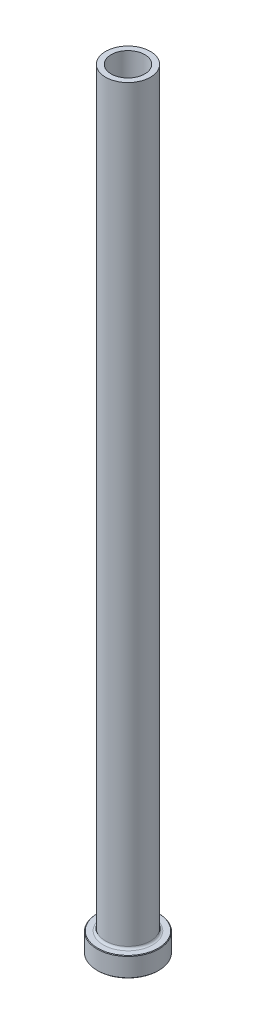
from build123d import *

# Parameters (mm, degrees)
FILLET1_R     = 0.8
CHAMFER1_SIZE = 0.2
CHAMFER3_SIZE = 0.5


with BuildPart() as part:
    # Sketch1 → Revolve1 (revolve)
    with BuildSketch(Plane.XY, mode=Mode.PRIVATE) as revolve1_sk:
        Polygon((-6, 275), (-8, 275), (-8, 7), (-11, 7), (-11, 0), (-6.25, 0), (-6.25, 208), (-6, 220), align=None)
    revolve(revolve1_sk.sketch.rotate(Axis((0, 92.187680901, 0), (0, -1, 0)), 270), axis=Axis((0, 92.187680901, 0), (0, -1, 0)))

    # Fillet1
    fillet1_edges = [part.edges().sort_by_distance(p)[0] for p in [
        (0, 7, -8),
    ]]
    fillet(fillet1_edges, radius=FILLET1_R)

    # Chamfer1
    chamfer1_edges = [part.edges().sort_by_distance(p)[0] for p in [
        (0, 0, -11),
        (0, 7, -11),
    ]]
    chamfer(chamfer1_edges, length=CHAMFER1_SIZE)

    # Chamfer3
    chamfer3_edges = [part.edges().sort_by_distance(p)[0] for p in [
        (0, 0, -6.25),
    ]]
    chamfer(chamfer3_edges, length=CHAMFER3_SIZE)


solid = part.part
